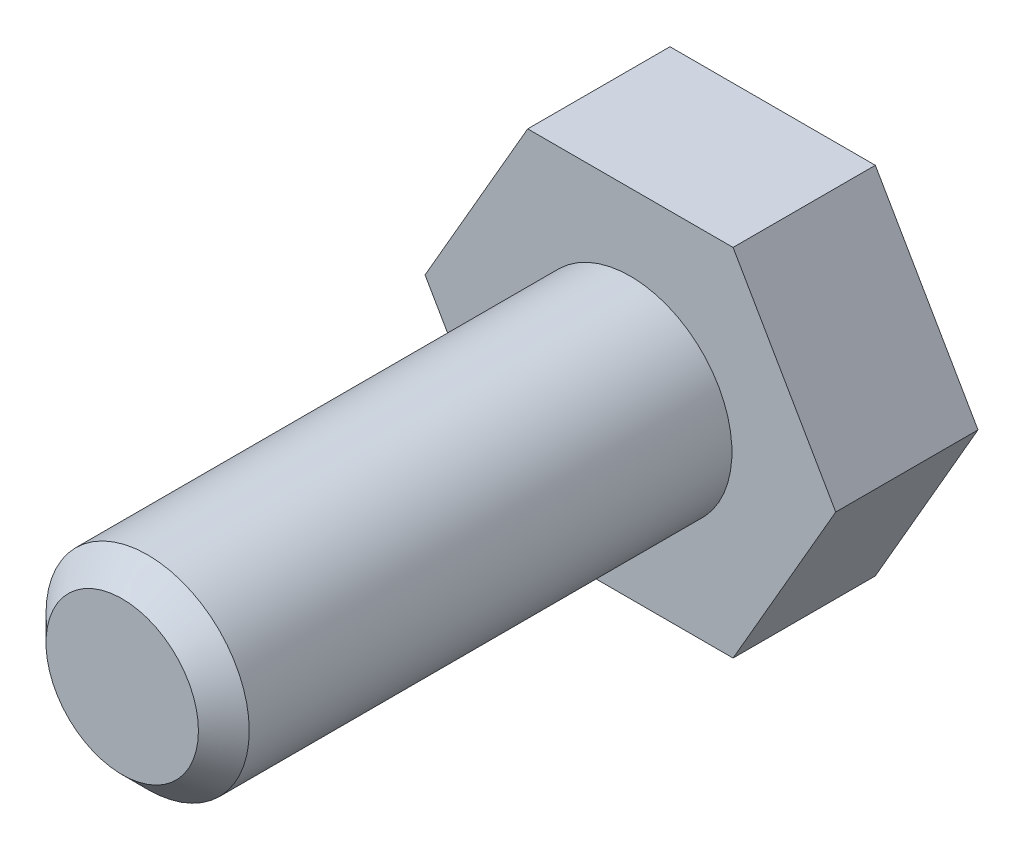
from build123d import *

# Parameters (mm, degrees)
BOSS_EXTRU_1_DEPTH = 2.8
ESQUISSE3_R        = 2
BOSS_EXTRU_2_DEPTH = 10
CHANFREIN1_SIZE    = 0.5


with BuildPart() as part:
    # Esquisse1 → Boss.-Extru.1 (new body)
    with BuildSketch(Plane.XY):
        Polygon((-2.019274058, -3.5), (-4.04, 0), (-2.019274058, 3.5), (2.022177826, 3.5), (4.042903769, 0), (2.022177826, -3.5), align=None)
    extrude(amount=BOSS_EXTRU_1_DEPTH)

    # Esquisse3 → Boss.-Extru.2 (add)
    with BuildSketch(Plane.XY.offset(2.8)):
        with Locations(Location((0, 0, 0), (0, 0, 180))):
            Circle(ESQUISSE3_R)
    extrude(amount=BOSS_EXTRU_2_DEPTH)

    # Chanfrein1
    chanfrein1_edges = [part.edges().sort_by_distance(p)[0] for p in [
        (2, 0, 12.8),
    ]]
    chamfer(chanfrein1_edges, length=CHANFREIN1_SIZE)


solid = part.part
